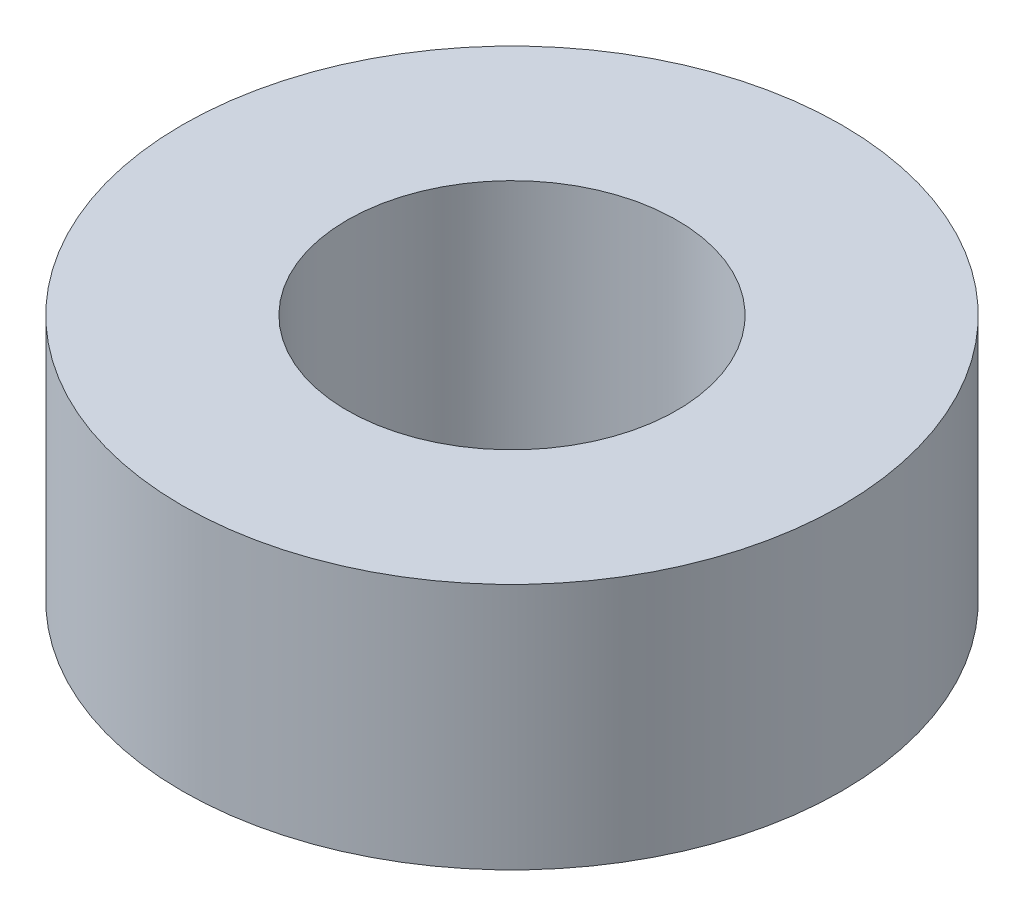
ISO-10303-21;
HEADER;
FILE_DESCRIPTION(('STEP AP214'),'2;1');
FILE_NAME('part.step','',(''),(''),'','','');
FILE_SCHEMA(('AUTOMOTIVE_DESIGN { 1 0 10303 214 1 1 1 1 }'));
ENDSEC;
DATA;
#1=APPLICATION_CONTEXT('core data for automotive mechanical design processes');
#2=APPLICATION_PROTOCOL_DEFINITION('international standard','automotive_design',2000,#1);
#3=PRODUCT_CONTEXT('',#1,'mechanical');
#4=PRODUCT('Part','Part','',(#3));
#5=PRODUCT_RELATED_PRODUCT_CATEGORY('part','',(#4));
#6=PRODUCT_DEFINITION_FORMATION('','',#4);
#7=PRODUCT_DEFINITION_CONTEXT('part definition',#1,'design');
#8=PRODUCT_DEFINITION('design','',#6,#7);
#9=PRODUCT_DEFINITION_SHAPE('','',#8);
#10=(LENGTH_UNIT() NAMED_UNIT(*) SI_UNIT(.MILLI.,.METRE.));
#11=(NAMED_UNIT(*) PLANE_ANGLE_UNIT() SI_UNIT($,.RADIAN.));
#12=(NAMED_UNIT(*) SI_UNIT($,.STERADIAN.) SOLID_ANGLE_UNIT());
#13=UNCERTAINTY_MEASURE_WITH_UNIT(LENGTH_MEASURE(1.E-05),#10,'distance_accuracy_value','');
#14=(GEOMETRIC_REPRESENTATION_CONTEXT(3) GLOBAL_UNCERTAINTY_ASSIGNED_CONTEXT((#13)) GLOBAL_UNIT_ASSIGNED_CONTEXT((#10,
#11,#12)) REPRESENTATION_CONTEXT('',''));
#15=CARTESIAN_POINT('',(0.,0.,0.));
#16=DIRECTION('',(0.,0.,1.));
#17=DIRECTION('',(1.,0.,0.));
#18=AXIS2_PLACEMENT_3D('',#15,#16,#17);
#19=CARTESIAN_POINT('',(0.,0.,0.));
#20=DIRECTION('',(0.,1.,0.));
#21=DIRECTION('',(-1.,0.,0.));
#22=AXIS2_PLACEMENT_3D('',#19,#20,#21);
#23=CYLINDRICAL_SURFACE('',#22,10.);
#24=CARTESIAN_POINT('',(0.,-15.,0.));
#25=DIRECTION('',(0.,1.,0.));
#26=DIRECTION('',(-1.,0.,0.));
#27=AXIS2_PLACEMENT_3D('',#24,#25,#26);
#28=CIRCLE('',#27,10.);
#29=CARTESIAN_POINT('',(-10.,-15.,0.));
#30=VERTEX_POINT('',#29);
#31=EDGE_CURVE('E49',#30,#30,#28,.T.);
#32=ORIENTED_EDGE('',*,*,#31,.F.);
#33=EDGE_LOOP('',(#32));
#34=FACE_BOUND('',#33,.T.);
#35=CARTESIAN_POINT('',(0.,0.,0.));
#36=DIRECTION('',(0.,1.,0.));
#37=DIRECTION('',(-1.,0.,0.));
#38=AXIS2_PLACEMENT_3D('',#35,#36,#37);
#39=CIRCLE('',#38,10.);
#40=CARTESIAN_POINT('',(-10.,0.,0.));
#41=VERTEX_POINT('',#40);
#42=EDGE_CURVE('E10',#41,#41,#39,.T.);
#43=ORIENTED_EDGE('',*,*,#42,.T.);
#44=EDGE_LOOP('',(#43));
#45=FACE_BOUND('',#44,.T.);
#46=ADVANCED_FACE('F35',(#34,#45),#23,.F.);
#47=CARTESIAN_POINT('',(0.,0.,0.));
#48=DIRECTION('',(0.,1.,0.));
#49=DIRECTION('',(-1.,0.,0.));
#50=AXIS2_PLACEMENT_3D('',#47,#48,#49);
#51=PLANE('',#50);
#52=CARTESIAN_POINT('',(0.,0.,0.));
#53=DIRECTION('',(0.,1.,0.));
#54=DIRECTION('',(-1.,0.,0.));
#55=AXIS2_PLACEMENT_3D('',#52,#53,#54);
#56=CIRCLE('',#55,20.);
#57=CARTESIAN_POINT('',(-20.,0.,0.));
#58=VERTEX_POINT('',#57);
#59=EDGE_CURVE('E41',#58,#58,#56,.T.);
#60=ORIENTED_EDGE('',*,*,#59,.T.);
#61=EDGE_LOOP('',(#60));
#62=FACE_BOUND('',#61,.T.);
#63=ORIENTED_EDGE('',*,*,#42,.F.);
#64=EDGE_LOOP('',(#63));
#65=FACE_BOUND('',#64,.T.);
#66=ADVANCED_FACE('F59',(#62,#65),#51,.T.);
#67=CARTESIAN_POINT('',(0.,0.,0.));
#68=DIRECTION('',(0.,1.,0.));
#69=DIRECTION('',(-1.,0.,0.));
#70=AXIS2_PLACEMENT_3D('',#67,#68,#69);
#71=CYLINDRICAL_SURFACE('',#70,20.);
#72=CARTESIAN_POINT('',(0.,-15.,0.));
#73=DIRECTION('',(0.,1.,0.));
#74=DIRECTION('',(-1.,0.,0.));
#75=AXIS2_PLACEMENT_3D('',#72,#73,#74);
#76=CIRCLE('',#75,20.);
#77=CARTESIAN_POINT('',(-20.,-15.,0.));
#78=VERTEX_POINT('',#77);
#79=EDGE_CURVE('E45',#78,#78,#76,.T.);
#80=ORIENTED_EDGE('',*,*,#79,.T.);
#81=EDGE_LOOP('',(#80));
#82=FACE_BOUND('',#81,.T.);
#83=ORIENTED_EDGE('',*,*,#59,.F.);
#84=EDGE_LOOP('',(#83));
#85=FACE_BOUND('',#84,.T.);
#86=ADVANCED_FACE('F63',(#82,#85),#71,.T.);
#87=CARTESIAN_POINT('',(0.,-15.,0.));
#88=DIRECTION('',(0.,-1.,0.));
#89=DIRECTION('',(1.,0.,0.));
#90=AXIS2_PLACEMENT_3D('',#87,#88,#89);
#91=PLANE('',#90);
#92=ORIENTED_EDGE('',*,*,#31,.T.);
#93=EDGE_LOOP('',(#92));
#94=FACE_BOUND('',#93,.T.);
#95=ORIENTED_EDGE('',*,*,#79,.F.);
#96=EDGE_LOOP('',(#95));
#97=FACE_BOUND('',#96,.T.);
#98=ADVANCED_FACE('F55',(#94,#97),#91,.T.);
#99=CLOSED_SHELL('',(#46,#66,#86,#98));
#100=MANIFOLD_SOLID_BREP('B2',#99);
#101=ADVANCED_BREP_SHAPE_REPRESENTATION('',(#18,#100),#14);
#102=SHAPE_DEFINITION_REPRESENTATION(#9,#101);
ENDSEC;
END-ISO-10303-21;
